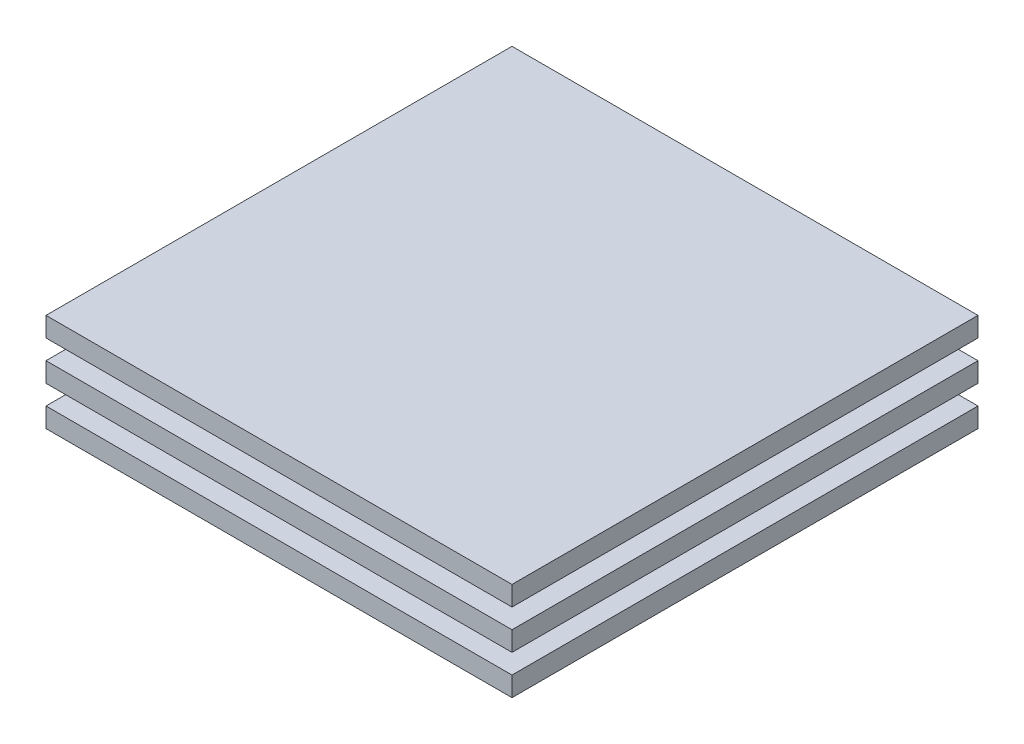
from build123d import *

# Parameters (mm, degrees)
SKETCH1_W           = 9.652
SKETCH1_H           = 9.652
BOSS_EXTRUDE1_DEPTH = 0.4064
SKETCH2_R           = 4.064
BOSS_EXTRUDE2_DEPTH = 0.4064
SKETCH3_W           = 9.652
SKETCH3_H           = 9.652
BOSS_EXTRUDE3_DEPTH = 0.4064
SKETCH4_R           = 4.064
BOSS_EXTRUDE4_DEPTH = 0.4064
SKETCH5_W           = 9.652
SKETCH5_H           = 9.652
BOSS_EXTRUDE5_DEPTH = 0.4064


with BuildPart() as part:
    # Sketch1 → Boss-Extrude1 (new body)
    with BuildSketch(Plane(origin=(0, 0, 0), x_dir=(1, 0, 0), z_dir=(0, 1, 0))):
        Rectangle(SKETCH1_W, SKETCH1_H)
    extrude(amount=BOSS_EXTRUDE1_DEPTH)

    # Sketch2 → Boss-Extrude2 (add)
    with BuildSketch(Plane(origin=(0, 0.4064, 0), x_dir=(1, 0, 0), z_dir=(0, 1, 0))):
        with Locations(Location((0, 0, 0), (0, 0, 270))):
            Circle(SKETCH2_R)
    extrude(amount=BOSS_EXTRUDE2_DEPTH)

    # Sketch3 → Boss-Extrude3 (add)
    with BuildSketch(Plane(origin=(0, 0.8128, 0), x_dir=(1, 0, 0), z_dir=(0, 1, 0))):
        Rectangle(SKETCH3_W, SKETCH3_H)
    extrude(amount=BOSS_EXTRUDE3_DEPTH)

    # Sketch4 → Boss-Extrude4 (add)
    with BuildSketch(Plane(origin=(0, 1.2192, 0), x_dir=(1, 0, 0), z_dir=(0, 1, 0))):
        with Locations(Location((0, 0, 0), (0, 0, 270))):
            Circle(SKETCH4_R)
    extrude(amount=BOSS_EXTRUDE4_DEPTH)

    # Sketch5 → Boss-Extrude5 (add)
    with BuildSketch(Plane(origin=(0, 1.6256, 0), x_dir=(1, 0, 0), z_dir=(0, 1, 0))):
        Rectangle(SKETCH5_W, SKETCH5_H)
    extrude(amount=BOSS_EXTRUDE5_DEPTH)


solid = part.part
